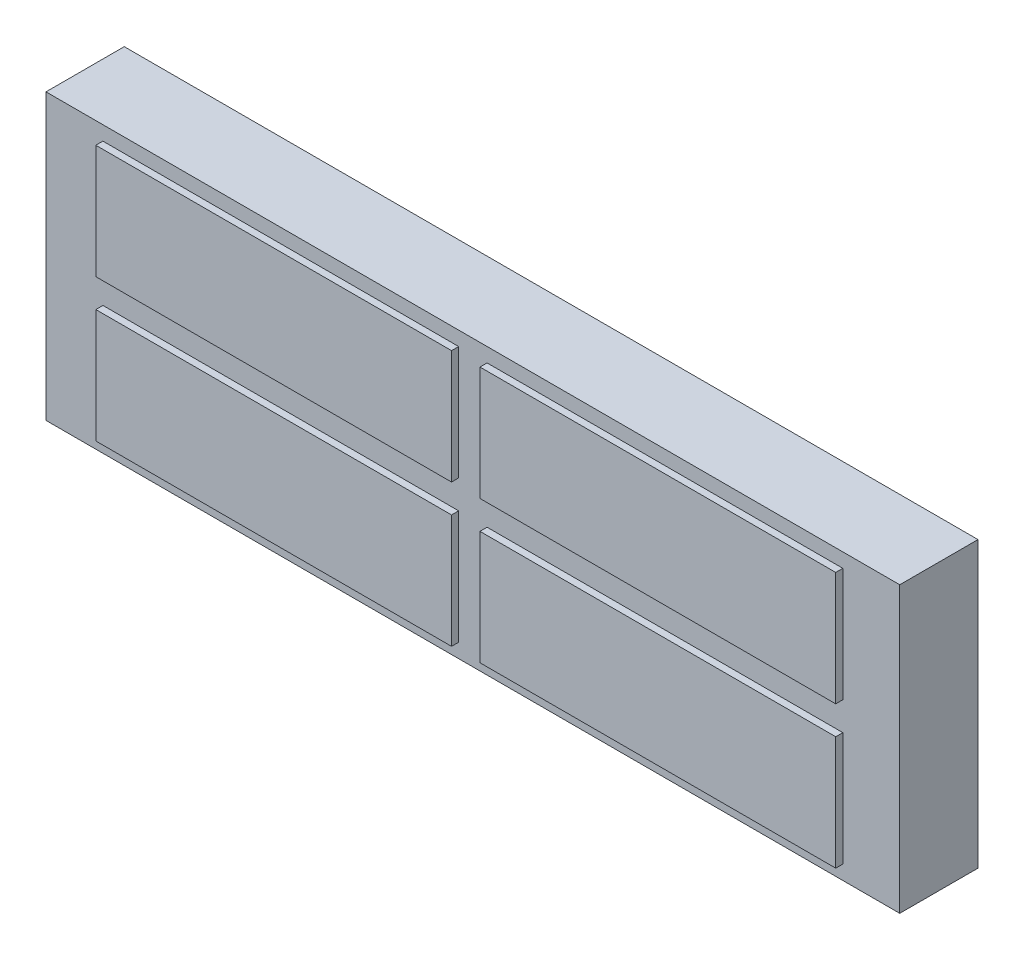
from build123d import *

# Parameters (mm, degrees)
ESQUISSE1_W      = 60
ESQUISSE1_H      = 20
EXTRUSION1_DEPTH = 5.5
ESQUISSE2_W      = 25
ESQUISSE2_H      = 8
EXTRUSION2_DEPTH = 0.5


with BuildPart() as part:
    # Esquisse1 → Extrusion1 (new body)
    with BuildSketch(Plane.XY):
        with Locations((-30, 10)):
            Rectangle(ESQUISSE1_W, ESQUISSE1_H)
    extrude(amount=EXTRUSION1_DEPTH)

    # Esquisse2 → Extrusion2 (add)
    with BuildSketch(Plane.XY.offset(5.5)):
        with Locations((-43.5, 15)):
            Rectangle(ESQUISSE2_W, ESQUISSE2_H)
        with Locations((-43.5, 5)):
            Rectangle(ESQUISSE2_W, ESQUISSE2_H)
        with Locations((-16.5, 15)):
            Rectangle(ESQUISSE2_W, ESQUISSE2_H)
        with Locations((-16.5, 5)):
            Rectangle(ESQUISSE2_W, ESQUISSE2_H)
    extrude(amount=EXTRUSION2_DEPTH)


solid = part.part
